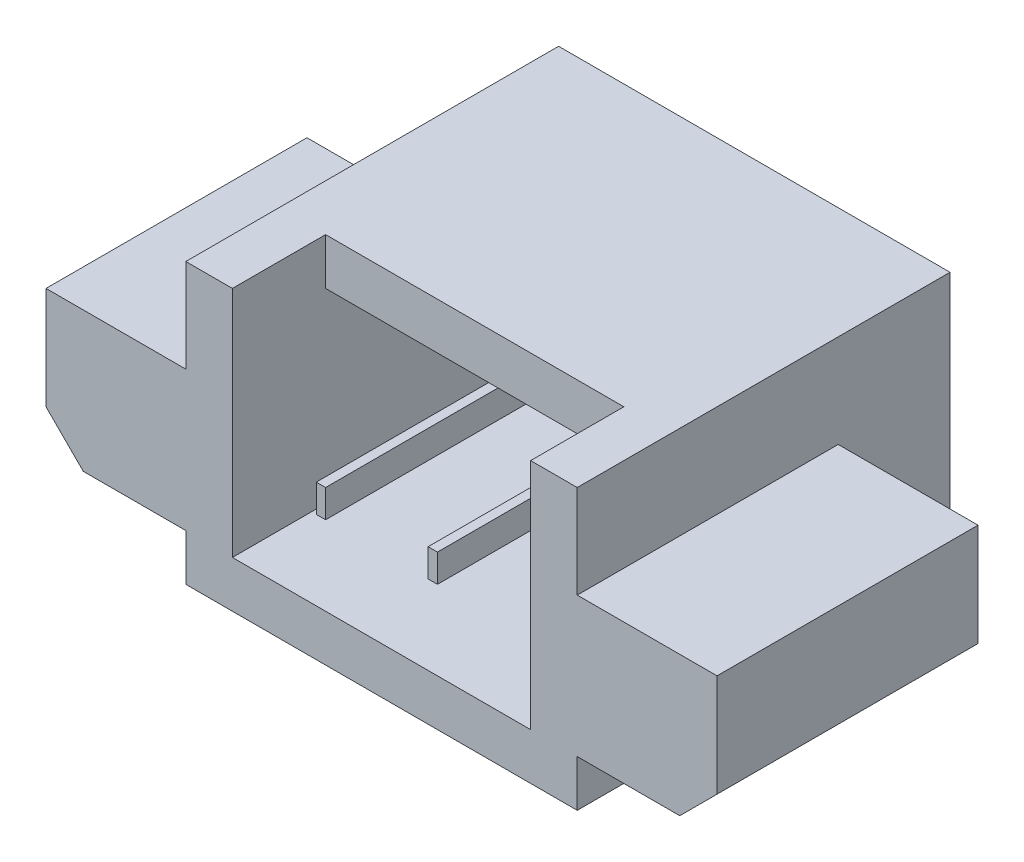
ISO-10303-21;
HEADER;
FILE_DESCRIPTION(('STEP AP214'),'2;1');
FILE_NAME('part.step','',(''),(''),'','','');
FILE_SCHEMA(('AUTOMOTIVE_DESIGN { 1 0 10303 214 1 1 1 1 }'));
ENDSEC;
DATA;
#1=APPLICATION_CONTEXT('core data for automotive mechanical design processes');
#2=APPLICATION_PROTOCOL_DEFINITION('international standard','automotive_design',2000,#1);
#3=PRODUCT_CONTEXT('',#1,'mechanical');
#4=PRODUCT('Part','Part','',(#3));
#5=PRODUCT_RELATED_PRODUCT_CATEGORY('part','',(#4));
#6=PRODUCT_DEFINITION_FORMATION('','',#4);
#7=PRODUCT_DEFINITION_CONTEXT('part definition',#1,'design');
#8=PRODUCT_DEFINITION('design','',#6,#7);
#9=PRODUCT_DEFINITION_SHAPE('','',#8);
#10=(LENGTH_UNIT() NAMED_UNIT(*) SI_UNIT(.MILLI.,.METRE.));
#11=(NAMED_UNIT(*) PLANE_ANGLE_UNIT() SI_UNIT($,.RADIAN.));
#12=(NAMED_UNIT(*) SI_UNIT($,.STERADIAN.) SOLID_ANGLE_UNIT());
#13=UNCERTAINTY_MEASURE_WITH_UNIT(LENGTH_MEASURE(1.E-05),#10,'distance_accuracy_value','');
#14=(GEOMETRIC_REPRESENTATION_CONTEXT(3) GLOBAL_UNCERTAINTY_ASSIGNED_CONTEXT((#13)) GLOBAL_UNIT_ASSIGNED_CONTEXT((#10,
#11,#12)) REPRESENTATION_CONTEXT('',''));
#15=CARTESIAN_POINT('',(0.,0.,0.));
#16=DIRECTION('',(0.,0.,1.));
#17=DIRECTION('',(1.,0.,0.));
#18=AXIS2_PLACEMENT_3D('',#15,#16,#17);
#19=CARTESIAN_POINT('',(0.,0.,0.5));
#20=DIRECTION('',(0.,0.,-1.));
#21=DIRECTION('',(-1.,0.,0.));
#22=AXIS2_PLACEMENT_3D('',#19,#20,#21);
#23=PLANE('',#22);
#24=DIRECTION('',(0.,1.,0.));
#25=VECTOR('',#24,1.);
#26=CARTESIAN_POINT('',(-0.6,0.15,0.5));
#27=LINE('',#26,#25);
#28=CARTESIAN_POINT('',(-0.6,-0.15,0.5));
#29=VERTEX_POINT('',#28);
#30=CARTESIAN_POINT('',(-0.6,0.15,0.5));
#31=VERTEX_POINT('',#30);
#32=EDGE_CURVE('E240',#29,#31,#27,.T.);
#33=ORIENTED_EDGE('',*,*,#32,.F.);
#34=DIRECTION('',(1.,0.,0.));
#35=VECTOR('',#34,1.);
#36=CARTESIAN_POINT('',(-0.7,-0.15,0.5));
#37=LINE('',#36,#35);
#38=CARTESIAN_POINT('',(-0.7,-0.15,0.5));
#39=VERTEX_POINT('',#38);
#40=EDGE_CURVE('E253',#39,#29,#37,.T.);
#41=ORIENTED_EDGE('',*,*,#40,.F.);
#42=DIRECTION('',(0.,-1.,0.));
#43=VECTOR('',#42,1.);
#44=CARTESIAN_POINT('',(-0.7,0.15,0.5));
#45=LINE('',#44,#43);
#46=CARTESIAN_POINT('',(-0.7,0.15,0.5));
#47=VERTEX_POINT('',#46);
#48=EDGE_CURVE('E262',#47,#39,#45,.T.);
#49=ORIENTED_EDGE('',*,*,#48,.F.);
#50=DIRECTION('',(-1.,0.,0.));
#51=VECTOR('',#50,1.);
#52=CARTESIAN_POINT('',(-0.7,0.15,0.5));
#53=LINE('',#52,#51);
#54=EDGE_CURVE('E243',#31,#47,#53,.T.);
#55=ORIENTED_EDGE('',*,*,#54,.F.);
#56=EDGE_LOOP('',(#33,#41,#49,#55));
#57=FACE_BOUND('',#56,.T.);
#58=DIRECTION('',(0.,1.,0.));
#59=VECTOR('',#58,1.);
#60=CARTESIAN_POINT('',(-1.6,1.,0.5));
#61=LINE('',#60,#59);
#62=CARTESIAN_POINT('',(-1.6,-1.,0.5));
#63=VERTEX_POINT('',#62);
#64=CARTESIAN_POINT('',(-1.6,1.,0.5));
#65=VERTEX_POINT('',#64);
#66=EDGE_CURVE('E300',#63,#65,#61,.T.);
#67=ORIENTED_EDGE('',*,*,#66,.F.);
#68=DIRECTION('',(-1.,0.,0.));
#69=VECTOR('',#68,1.);
#70=CARTESIAN_POINT('',(-1.6,-1.,0.5));
#71=LINE('',#70,#69);
#72=CARTESIAN_POINT('',(1.6,-1.,0.5));
#73=VERTEX_POINT('',#72);
#74=EDGE_CURVE('E297',#73,#63,#71,.T.);
#75=ORIENTED_EDGE('',*,*,#74,.F.);
#76=DIRECTION('',(0.,-1.,0.));
#77=VECTOR('',#76,1.);
#78=CARTESIAN_POINT('',(1.6,1.,0.5));
#79=LINE('',#78,#77);
#80=CARTESIAN_POINT('',(1.6,1.,0.5));
#81=VERTEX_POINT('',#80);
#82=EDGE_CURVE('E293',#81,#73,#79,.T.);
#83=ORIENTED_EDGE('',*,*,#82,.F.);
#84=DIRECTION('',(1.,0.,0.));
#85=VECTOR('',#84,1.);
#86=CARTESIAN_POINT('',(-1.6,1.,0.5));
#87=LINE('',#86,#85);
#88=EDGE_CURVE('E11',#65,#81,#87,.T.);
#89=ORIENTED_EDGE('',*,*,#88,.F.);
#90=EDGE_LOOP('',(#67,#75,#83,#89));
#91=FACE_BOUND('',#90,.T.);
#92=DIRECTION('',(1.,0.,0.));
#93=VECTOR('',#92,1.);
#94=CARTESIAN_POINT('',(0.499999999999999,-0.15,0.5));
#95=LINE('',#94,#93);
#96=CARTESIAN_POINT('',(0.499999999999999,-0.15,0.5));
#97=VERTEX_POINT('',#96);
#98=CARTESIAN_POINT('',(0.599999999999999,-0.15,0.5));
#99=VERTEX_POINT('',#98);
#100=EDGE_CURVE('E239',#97,#99,#95,.T.);
#101=ORIENTED_EDGE('',*,*,#100,.F.);
#102=DIRECTION('',(0.,-1.,0.));
#103=VECTOR('',#102,1.);
#104=CARTESIAN_POINT('',(0.499999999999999,0.15,0.5));
#105=LINE('',#104,#103);
#106=CARTESIAN_POINT('',(0.499999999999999,0.15,0.5));
#107=VERTEX_POINT('',#106);
#108=EDGE_CURVE('E236',#107,#97,#105,.T.);
#109=ORIENTED_EDGE('',*,*,#108,.F.);
#110=DIRECTION('',(-1.,0.,0.));
#111=VECTOR('',#110,1.);
#112=CARTESIAN_POINT('',(0.499999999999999,0.15,0.5));
#113=LINE('',#112,#111);
#114=CARTESIAN_POINT('',(0.599999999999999,0.15,0.5));
#115=VERTEX_POINT('',#114);
#116=EDGE_CURVE('E54',#115,#107,#113,.T.);
#117=ORIENTED_EDGE('',*,*,#116,.F.);
#118=DIRECTION('',(0.,1.,0.));
#119=VECTOR('',#118,1.);
#120=CARTESIAN_POINT('',(0.599999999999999,0.15,0.5));
#121=LINE('',#120,#119);
#122=EDGE_CURVE('E49',#99,#115,#121,.T.);
#123=ORIENTED_EDGE('',*,*,#122,.F.);
#124=EDGE_LOOP('',(#101,#109,#117,#123));
#125=FACE_BOUND('',#124,.T.);
#126=ADVANCED_FACE('F34',(#57,#91,#125),#23,.F.);
#127=CARTESIAN_POINT('',(-1.6,1.,4.));
#128=DIRECTION('',(1.,0.,0.));
#129=DIRECTION('',(0.,1.,0.));
#130=AXIS2_PLACEMENT_3D('',#127,#128,#129);
#131=PLANE('',#130);
#132=DIRECTION('',(0.,0.,-1.));
#133=VECTOR('',#132,1.);
#134=CARTESIAN_POINT('',(-1.6,-1.,4.));
#135=LINE('',#134,#133);
#136=CARTESIAN_POINT('',(-1.6,-1.,4.));
#137=VERTEX_POINT('',#136);
#138=EDGE_CURVE('E391',#137,#63,#135,.T.);
#139=ORIENTED_EDGE('',*,*,#138,.T.);
#140=ORIENTED_EDGE('',*,*,#66,.T.);
#141=DIRECTION('',(0.,0.,-1.));
#142=VECTOR('',#141,1.);
#143=CARTESIAN_POINT('',(-1.6,1.,4.));
#144=LINE('',#143,#142);
#145=CARTESIAN_POINT('',(-1.6,1.,3.));
#146=VERTEX_POINT('',#145);
#147=EDGE_CURVE('E384',#146,#65,#144,.T.);
#148=ORIENTED_EDGE('',*,*,#147,.F.);
#149=DIRECTION('',(0.,1.,0.));
#150=VECTOR('',#149,1.);
#151=CARTESIAN_POINT('',(-1.6,1.,3.));
#152=LINE('',#151,#150);
#153=CARTESIAN_POINT('',(-1.6,1.5,3.));
#154=VERTEX_POINT('',#153);
#155=EDGE_CURVE('E291',#146,#154,#152,.T.);
#156=ORIENTED_EDGE('',*,*,#155,.T.);
#157=DIRECTION('',(0.,0.,1.));
#158=VECTOR('',#157,1.);
#159=CARTESIAN_POINT('',(-1.6,1.5,4.));
#160=LINE('',#159,#158);
#161=CARTESIAN_POINT('',(-1.6,1.5,4.));
#162=VERTEX_POINT('',#161);
#163=EDGE_CURVE('E278',#154,#162,#160,.T.);
#164=ORIENTED_EDGE('',*,*,#163,.T.);
#165=DIRECTION('',(0.,-1.,0.));
#166=VECTOR('',#165,1.);
#167=CARTESIAN_POINT('',(-1.6,1.,4.));
#168=LINE('',#167,#166);
#169=EDGE_CURVE('E370',#162,#137,#168,.T.);
#170=ORIENTED_EDGE('',*,*,#169,.T.);
#171=EDGE_LOOP('',(#139,#140,#148,#156,#164,#170));
#172=FACE_BOUND('',#171,.T.);
#173=ADVANCED_FACE('F458',(#172),#131,.T.);
#174=CARTESIAN_POINT('',(-1.6,-1.,4.));
#175=DIRECTION('',(0.,1.,0.));
#176=DIRECTION('',(-1.,0.,0.));
#177=AXIS2_PLACEMENT_3D('',#174,#175,#176);
#178=PLANE('',#177);
#179=DIRECTION('',(0.,0.,-1.));
#180=VECTOR('',#179,1.);
#181=CARTESIAN_POINT('',(1.6,-1.,4.));
#182=LINE('',#181,#180);
#183=CARTESIAN_POINT('',(1.6,-1.,4.));
#184=VERTEX_POINT('',#183);
#185=EDGE_CURVE('E388',#184,#73,#182,.T.);
#186=ORIENTED_EDGE('',*,*,#185,.T.);
#187=ORIENTED_EDGE('',*,*,#74,.T.);
#188=ORIENTED_EDGE('',*,*,#138,.F.);
#189=DIRECTION('',(1.,0.,0.));
#190=VECTOR('',#189,1.);
#191=CARTESIAN_POINT('',(-1.6,-1.,4.));
#192=LINE('',#191,#190);
#193=EDGE_CURVE('E380',#137,#184,#192,.T.);
#194=ORIENTED_EDGE('',*,*,#193,.T.);
#195=EDGE_LOOP('',(#186,#187,#188,#194));
#196=FACE_BOUND('',#195,.T.);
#197=ADVANCED_FACE('F510',(#196),#178,.T.);
#198=CARTESIAN_POINT('',(1.6,1.,4.));
#199=DIRECTION('',(-1.,0.,0.));
#200=DIRECTION('',(0.,-1.,0.));
#201=AXIS2_PLACEMENT_3D('',#198,#199,#200);
#202=PLANE('',#201);
#203=DIRECTION('',(0.,1.,0.));
#204=VECTOR('',#203,1.);
#205=CARTESIAN_POINT('',(1.6,1.,4.));
#206=LINE('',#205,#204);
#207=CARTESIAN_POINT('',(1.6,1.5,4.));
#208=VERTEX_POINT('',#207);
#209=EDGE_CURVE('E382',#184,#208,#206,.T.);
#210=ORIENTED_EDGE('',*,*,#209,.T.);
#211=DIRECTION('',(0.,0.,-1.));
#212=VECTOR('',#211,1.);
#213=CARTESIAN_POINT('',(1.6,1.5,4.));
#214=LINE('',#213,#212);
#215=CARTESIAN_POINT('',(1.6,1.5,3.));
#216=VERTEX_POINT('',#215);
#217=EDGE_CURVE('E286',#208,#216,#214,.T.);
#218=ORIENTED_EDGE('',*,*,#217,.T.);
#219=DIRECTION('',(0.,1.,0.));
#220=VECTOR('',#219,1.);
#221=CARTESIAN_POINT('',(1.6,1.,3.));
#222=LINE('',#221,#220);
#223=CARTESIAN_POINT('',(1.6,1.,3.));
#224=VERTEX_POINT('',#223);
#225=EDGE_CURVE('E282',#224,#216,#222,.T.);
#226=ORIENTED_EDGE('',*,*,#225,.F.);
#227=DIRECTION('',(0.,0.,-1.));
#228=VECTOR('',#227,1.);
#229=CARTESIAN_POINT('',(1.6,1.,4.));
#230=LINE('',#229,#228);
#231=EDGE_CURVE('E386',#224,#81,#230,.T.);
#232=ORIENTED_EDGE('',*,*,#231,.T.);
#233=ORIENTED_EDGE('',*,*,#82,.T.);
#234=ORIENTED_EDGE('',*,*,#185,.F.);
#235=EDGE_LOOP('',(#210,#218,#226,#232,#233,#234));
#236=FACE_BOUND('',#235,.T.);
#237=ADVANCED_FACE('F541',(#236),#202,.T.);
#238=CARTESIAN_POINT('',(-1.6,1.,4.));
#239=DIRECTION('',(0.,-1.,0.));
#240=DIRECTION('',(0.,0.,-1.));
#241=AXIS2_PLACEMENT_3D('',#238,#239,#240);
#242=PLANE('',#241);
#243=DIRECTION('',(-1.,0.,0.));
#244=VECTOR('',#243,1.);
#245=CARTESIAN_POINT('',(-1.6,1.,3.));
#246=LINE('',#245,#244);
#247=EDGE_CURVE('E279',#224,#146,#246,.T.);
#248=ORIENTED_EDGE('',*,*,#247,.T.);
#249=ORIENTED_EDGE('',*,*,#147,.T.);
#250=ORIENTED_EDGE('',*,*,#88,.T.);
#251=ORIENTED_EDGE('',*,*,#231,.F.);
#252=EDGE_LOOP('',(#248,#249,#250,#251));
#253=FACE_BOUND('',#252,.T.);
#254=ADVANCED_FACE('F538',(#253),#242,.T.);
#255=CARTESIAN_POINT('',(2.1,1.5,4.));
#256=DIRECTION('',(-1.,0.,0.));
#257=DIRECTION('',(0.,-1.,0.));
#258=AXIS2_PLACEMENT_3D('',#255,#256,#257);
#259=PLANE('',#258);
#260=DIRECTION('',(0.,1.,0.));
#261=VECTOR('',#260,1.);
#262=CARTESIAN_POINT('',(2.1,1.5,0.));
#263=LINE('',#262,#261);
#264=CARTESIAN_POINT('',(2.1,-1.5,0.));
#265=VERTEX_POINT('',#264);
#266=CARTESIAN_POINT('',(2.1,1.5,0.));
#267=VERTEX_POINT('',#266);
#268=EDGE_CURVE('E394',#265,#267,#263,.T.);
#269=ORIENTED_EDGE('',*,*,#268,.T.);
#270=DIRECTION('',(0.,0.,-1.));
#271=VECTOR('',#270,1.);
#272=CARTESIAN_POINT('',(2.1,1.5,4.));
#273=LINE('',#272,#271);
#274=CARTESIAN_POINT('',(2.1,1.5,4.));
#275=VERTEX_POINT('',#274);
#276=EDGE_CURVE('E42',#275,#267,#273,.T.);
#277=ORIENTED_EDGE('',*,*,#276,.F.);
#278=DIRECTION('',(0.,1.,0.));
#279=VECTOR('',#278,1.);
#280=CARTESIAN_POINT('',(2.1,1.5,4.));
#281=LINE('',#280,#279);
#282=CARTESIAN_POINT('',(2.1,0.5,4.));
#283=VERTEX_POINT('',#282);
#284=EDGE_CURVE('E399',#283,#275,#281,.T.);
#285=ORIENTED_EDGE('',*,*,#284,.F.);
#286=DIRECTION('',(0.,0.,1.));
#287=VECTOR('',#286,1.);
#288=CARTESIAN_POINT('',(2.1,0.5,1.2));
#289=LINE('',#288,#287);
#290=CARTESIAN_POINT('',(2.1,0.5,1.2));
#291=VERTEX_POINT('',#290);
#292=EDGE_CURVE('E334',#291,#283,#289,.T.);
#293=ORIENTED_EDGE('',*,*,#292,.F.);
#294=DIRECTION('',(0.,-1.,0.));
#295=VECTOR('',#294,1.);
#296=CARTESIAN_POINT('',(2.1,-1.,1.2));
#297=LINE('',#296,#295);
#298=CARTESIAN_POINT('',(2.1,-1.,1.2));
#299=VERTEX_POINT('',#298);
#300=EDGE_CURVE('E316',#291,#299,#297,.T.);
#301=ORIENTED_EDGE('',*,*,#300,.T.);
#302=DIRECTION('',(0.,0.,1.));
#303=VECTOR('',#302,1.);
#304=CARTESIAN_POINT('',(2.1,-1.,1.2));
#305=LINE('',#304,#303);
#306=CARTESIAN_POINT('',(2.1,-1.,4.));
#307=VERTEX_POINT('',#306);
#308=EDGE_CURVE('E330',#299,#307,#305,.T.);
#309=ORIENTED_EDGE('',*,*,#308,.T.);
#310=CARTESIAN_POINT('',(2.1,-1.5,4.));
#311=VERTEX_POINT('',#310);
#312=EDGE_CURVE('E395',#311,#307,#281,.T.);
#313=ORIENTED_EDGE('',*,*,#312,.F.);
#314=DIRECTION('',(0.,0.,-1.));
#315=VECTOR('',#314,1.);
#316=CARTESIAN_POINT('',(2.1,-1.5,4.));
#317=LINE('',#316,#315);
#318=EDGE_CURVE('E409',#311,#265,#317,.T.);
#319=ORIENTED_EDGE('',*,*,#318,.T.);
#320=EDGE_LOOP('',(#269,#277,#285,#293,#301,#309,#313,#319));
#321=FACE_BOUND('',#320,.T.);
#322=ADVANCED_FACE('F36',(#321),#259,.F.);
#323=CARTESIAN_POINT('',(-2.1,1.5,4.));
#324=DIRECTION('',(1.,0.,0.));
#325=DIRECTION('',(0.,0.,-1.));
#326=AXIS2_PLACEMENT_3D('',#323,#324,#325);
#327=PLANE('',#326);
#328=DIRECTION('',(0.,-1.,0.));
#329=VECTOR('',#328,1.);
#330=CARTESIAN_POINT('',(-2.1,1.5,0.));
#331=LINE('',#330,#329);
#332=CARTESIAN_POINT('',(-2.1,1.5,0.));
#333=VERTEX_POINT('',#332);
#334=CARTESIAN_POINT('',(-2.1,-1.5,0.));
#335=VERTEX_POINT('',#334);
#336=EDGE_CURVE('E415',#333,#335,#331,.T.);
#337=ORIENTED_EDGE('',*,*,#336,.T.);
#338=DIRECTION('',(0.,0.,-1.));
#339=VECTOR('',#338,1.);
#340=CARTESIAN_POINT('',(-2.1,-1.5,4.));
#341=LINE('',#340,#339);
#342=CARTESIAN_POINT('',(-2.1,-1.5,4.));
#343=VERTEX_POINT('',#342);
#344=EDGE_CURVE('E422',#343,#335,#341,.T.);
#345=ORIENTED_EDGE('',*,*,#344,.F.);
#346=DIRECTION('',(0.,-1.,0.));
#347=VECTOR('',#346,1.);
#348=CARTESIAN_POINT('',(-2.1,1.5,4.));
#349=LINE('',#348,#347);
#350=CARTESIAN_POINT('',(-2.1,-1.,4.));
#351=VERTEX_POINT('',#350);
#352=EDGE_CURVE('E403',#351,#343,#349,.T.);
#353=ORIENTED_EDGE('',*,*,#352,.F.);
#354=DIRECTION('',(0.,0.,1.));
#355=VECTOR('',#354,1.);
#356=CARTESIAN_POINT('',(-2.1,-1.,1.2));
#357=LINE('',#356,#355);
#358=CARTESIAN_POINT('',(-2.1,-1.,1.2));
#359=VERTEX_POINT('',#358);
#360=EDGE_CURVE('E368',#359,#351,#357,.T.);
#361=ORIENTED_EDGE('',*,*,#360,.F.);
#362=DIRECTION('',(0.,1.,0.));
#363=VECTOR('',#362,1.);
#364=CARTESIAN_POINT('',(-2.1,-1.,1.2));
#365=LINE('',#364,#363);
#366=CARTESIAN_POINT('',(-2.1,0.5,1.2));
#367=VERTEX_POINT('',#366);
#368=EDGE_CURVE('E341',#359,#367,#365,.T.);
#369=ORIENTED_EDGE('',*,*,#368,.T.);
#370=DIRECTION('',(0.,0.,1.));
#371=VECTOR('',#370,1.);
#372=CARTESIAN_POINT('',(-2.1,0.5,1.2));
#373=LINE('',#372,#371);
#374=CARTESIAN_POINT('',(-2.1,0.5,4.));
#375=VERTEX_POINT('',#374);
#376=EDGE_CURVE('E357',#367,#375,#373,.T.);
#377=ORIENTED_EDGE('',*,*,#376,.T.);
#378=CARTESIAN_POINT('',(-2.1,1.5,4.));
#379=VERTEX_POINT('',#378);
#380=EDGE_CURVE('E404',#379,#375,#349,.T.);
#381=ORIENTED_EDGE('',*,*,#380,.F.);
#382=DIRECTION('',(0.,0.,-1.));
#383=VECTOR('',#382,1.);
#384=CARTESIAN_POINT('',(-2.1,1.5,4.));
#385=LINE('',#384,#383);
#386=EDGE_CURVE('E424',#379,#333,#385,.T.);
#387=ORIENTED_EDGE('',*,*,#386,.T.);
#388=EDGE_LOOP('',(#337,#345,#353,#361,#369,#377,#381,#387));
#389=FACE_BOUND('',#388,.T.);
#390=ADVANCED_FACE('F448',(#389),#327,.F.);
#391=CARTESIAN_POINT('',(0.,0.,4.));
#392=DIRECTION('',(0.,0.,1.));
#393=DIRECTION('',(1.,0.,0.));
#394=AXIS2_PLACEMENT_3D('',#391,#392,#393);
#395=PLANE('',#394);
#396=ORIENTED_EDGE('',*,*,#169,.F.);
#397=DIRECTION('',(-1.,0.,0.));
#398=VECTOR('',#397,1.);
#399=CARTESIAN_POINT('',(-2.1,1.5,4.));
#400=LINE('',#399,#398);
#401=EDGE_CURVE('E398',#162,#379,#400,.T.);
#402=ORIENTED_EDGE('',*,*,#401,.T.);
#403=ORIENTED_EDGE('',*,*,#380,.T.);
#404=DIRECTION('',(-1.,0.,0.));
#405=VECTOR('',#404,1.);
#406=CARTESIAN_POINT('',(-2.1,0.5,4.));
#407=LINE('',#406,#405);
#408=CARTESIAN_POINT('',(-3.6,0.5,4.));
#409=VERTEX_POINT('',#408);
#410=EDGE_CURVE('E333',#375,#409,#407,.T.);
#411=ORIENTED_EDGE('',*,*,#410,.T.);
#412=DIRECTION('',(0.,-1.,0.));
#413=VECTOR('',#412,1.);
#414=CARTESIAN_POINT('',(-3.6,-0.600000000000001,4.));
#415=LINE('',#414,#413);
#416=CARTESIAN_POINT('',(-3.6,-0.600000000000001,4.));
#417=VERTEX_POINT('',#416);
#418=EDGE_CURVE('E360',#409,#417,#415,.T.);
#419=ORIENTED_EDGE('',*,*,#418,.T.);
#420=DIRECTION('',(0.707106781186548,-0.707106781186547,0.));
#421=VECTOR('',#420,1.);
#422=CARTESIAN_POINT('',(-3.2,-1.,4.));
#423=LINE('',#422,#421);
#424=CARTESIAN_POINT('',(-3.2,-1.,4.));
#425=VERTEX_POINT('',#424);
#426=EDGE_CURVE('E363',#417,#425,#423,.T.);
#427=ORIENTED_EDGE('',*,*,#426,.T.);
#428=DIRECTION('',(1.,0.,0.));
#429=VECTOR('',#428,1.);
#430=CARTESIAN_POINT('',(-2.1,-1.,4.));
#431=LINE('',#430,#429);
#432=EDGE_CURVE('E345',#425,#351,#431,.T.);
#433=ORIENTED_EDGE('',*,*,#432,.T.);
#434=ORIENTED_EDGE('',*,*,#352,.T.);
#435=DIRECTION('',(1.,0.,0.));
#436=VECTOR('',#435,1.);
#437=CARTESIAN_POINT('',(-2.1,-1.5,4.));
#438=LINE('',#437,#436);
#439=EDGE_CURVE('E407',#343,#311,#438,.T.);
#440=ORIENTED_EDGE('',*,*,#439,.T.);
#441=ORIENTED_EDGE('',*,*,#312,.T.);
#442=DIRECTION('',(1.,0.,0.));
#443=VECTOR('',#442,1.);
#444=CARTESIAN_POINT('',(2.1,-1.,4.));
#445=LINE('',#444,#443);
#446=CARTESIAN_POINT('',(3.2,-1.,4.));
#447=VERTEX_POINT('',#446);
#448=EDGE_CURVE('E303',#307,#447,#445,.T.);
#449=ORIENTED_EDGE('',*,*,#448,.T.);
#450=DIRECTION('',(0.707106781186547,0.707106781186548,0.));
#451=VECTOR('',#450,1.);
#452=CARTESIAN_POINT('',(3.2,-1.,4.));
#453=LINE('',#452,#451);
#454=CARTESIAN_POINT('',(3.6,-0.6,4.));
#455=VERTEX_POINT('',#454);
#456=EDGE_CURVE('E322',#447,#455,#453,.T.);
#457=ORIENTED_EDGE('',*,*,#456,.T.);
#458=DIRECTION('',(0.,1.,0.));
#459=VECTOR('',#458,1.);
#460=CARTESIAN_POINT('',(3.6,-0.6,4.));
#461=LINE('',#460,#459);
#462=CARTESIAN_POINT('',(3.6,0.5,4.));
#463=VERTEX_POINT('',#462);
#464=EDGE_CURVE('E325',#455,#463,#461,.T.);
#465=ORIENTED_EDGE('',*,*,#464,.T.);
#466=DIRECTION('',(-1.,0.,0.));
#467=VECTOR('',#466,1.);
#468=CARTESIAN_POINT('',(2.1,0.5,4.));
#469=LINE('',#468,#467);
#470=EDGE_CURVE('E308',#463,#283,#469,.T.);
#471=ORIENTED_EDGE('',*,*,#470,.T.);
#472=ORIENTED_EDGE('',*,*,#284,.T.);
#473=EDGE_CURVE('E400',#275,#208,#400,.T.);
#474=ORIENTED_EDGE('',*,*,#473,.T.);
#475=ORIENTED_EDGE('',*,*,#209,.F.);
#476=ORIENTED_EDGE('',*,*,#193,.F.);
#477=EDGE_LOOP('',(#396,#402,#403,#411,#419,#427,#433,#434,#440,#441,#449,#457,#465,#471,#472,
#474,#475,#476));
#478=FACE_BOUND('',#477,.T.);
#479=ADVANCED_FACE('F453',(#478),#395,.T.);
#480=CARTESIAN_POINT('',(0.,0.,0.));
#481=DIRECTION('',(0.,0.,1.));
#482=DIRECTION('',(1.,0.,0.));
#483=AXIS2_PLACEMENT_3D('',#480,#481,#482);
#484=PLANE('',#483);
#485=ORIENTED_EDGE('',*,*,#268,.F.);
#486=DIRECTION('',(1.,0.,0.));
#487=VECTOR('',#486,1.);
#488=CARTESIAN_POINT('',(-2.1,-1.5,0.));
#489=LINE('',#488,#487);
#490=EDGE_CURVE('E418',#335,#265,#489,.T.);
#491=ORIENTED_EDGE('',*,*,#490,.F.);
#492=ORIENTED_EDGE('',*,*,#336,.F.);
#493=DIRECTION('',(-1.,0.,0.));
#494=VECTOR('',#493,1.);
#495=CARTESIAN_POINT('',(-2.1,1.5,0.));
#496=LINE('',#495,#494);
#497=EDGE_CURVE('E412',#267,#333,#496,.T.);
#498=ORIENTED_EDGE('',*,*,#497,.F.);
#499=EDGE_LOOP('',(#485,#491,#492,#498));
#500=FACE_BOUND('',#499,.T.);
#501=ADVANCED_FACE('F438',(#500),#484,.F.);
#502=CARTESIAN_POINT('',(-2.1,1.5,4.));
#503=DIRECTION('',(0.,-1.,0.));
#504=DIRECTION('',(0.,0.,-1.));
#505=AXIS2_PLACEMENT_3D('',#502,#503,#504);
#506=PLANE('',#505);
#507=ORIENTED_EDGE('',*,*,#401,.F.);
#508=ORIENTED_EDGE('',*,*,#163,.F.);
#509=DIRECTION('',(-1.,0.,0.));
#510=VECTOR('',#509,1.);
#511=CARTESIAN_POINT('',(-1.6,1.5,3.));
#512=LINE('',#511,#510);
#513=EDGE_CURVE('E283',#216,#154,#512,.T.);
#514=ORIENTED_EDGE('',*,*,#513,.F.);
#515=ORIENTED_EDGE('',*,*,#217,.F.);
#516=ORIENTED_EDGE('',*,*,#473,.F.);
#517=ORIENTED_EDGE('',*,*,#276,.T.);
#518=ORIENTED_EDGE('',*,*,#497,.T.);
#519=ORIENTED_EDGE('',*,*,#386,.F.);
#520=EDGE_LOOP('',(#507,#508,#514,#515,#516,#517,#518,#519));
#521=FACE_BOUND('',#520,.T.);
#522=ADVANCED_FACE('F430',(#521),#506,.F.);
#523=CARTESIAN_POINT('',(-2.1,-1.5,4.));
#524=DIRECTION('',(0.,1.,0.));
#525=DIRECTION('',(0.,0.,1.));
#526=AXIS2_PLACEMENT_3D('',#523,#524,#525);
#527=PLANE('',#526);
#528=ORIENTED_EDGE('',*,*,#490,.T.);
#529=ORIENTED_EDGE('',*,*,#318,.F.);
#530=ORIENTED_EDGE('',*,*,#439,.F.);
#531=ORIENTED_EDGE('',*,*,#344,.T.);
#532=EDGE_LOOP('',(#528,#529,#530,#531));
#533=FACE_BOUND('',#532,.T.);
#534=ADVANCED_FACE('F444',(#533),#527,.F.);
#535=CARTESIAN_POINT('',(-2.1,-1.,1.2));
#536=DIRECTION('',(0.,-1.,0.));
#537=DIRECTION('',(1.,0.,0.));
#538=AXIS2_PLACEMENT_3D('',#535,#536,#537);
#539=PLANE('',#538);
#540=ORIENTED_EDGE('',*,*,#432,.F.);
#541=DIRECTION('',(0.,0.,1.));
#542=VECTOR('',#541,1.);
#543=CARTESIAN_POINT('',(-3.2,-1.,1.2));
#544=LINE('',#543,#542);
#545=CARTESIAN_POINT('',(-3.2,-1.,1.2));
#546=VERTEX_POINT('',#545);
#547=EDGE_CURVE('E371',#546,#425,#544,.T.);
#548=ORIENTED_EDGE('',*,*,#547,.F.);
#549=DIRECTION('',(1.,0.,0.));
#550=VECTOR('',#549,1.);
#551=CARTESIAN_POINT('',(-2.1,-1.,1.2));
#552=LINE('',#551,#550);
#553=EDGE_CURVE('E354',#546,#359,#552,.T.);
#554=ORIENTED_EDGE('',*,*,#553,.T.);
#555=ORIENTED_EDGE('',*,*,#360,.T.);
#556=EDGE_LOOP('',(#540,#548,#554,#555));
#557=FACE_BOUND('',#556,.T.);
#558=ADVANCED_FACE('F481',(#557),#539,.T.);
#559=CARTESIAN_POINT('',(-3.2,-1.,1.2));
#560=DIRECTION('',(-0.707106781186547,-0.707106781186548,0.));
#561=DIRECTION('',(0.707106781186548,-0.707106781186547,0.));
#562=AXIS2_PLACEMENT_3D('',#559,#560,#561);
#563=PLANE('',#562);
#564=ORIENTED_EDGE('',*,*,#426,.F.);
#565=DIRECTION('',(0.,0.,1.));
#566=VECTOR('',#565,1.);
#567=CARTESIAN_POINT('',(-3.6,-0.600000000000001,1.2));
#568=LINE('',#567,#566);
#569=CARTESIAN_POINT('',(-3.6,-0.600000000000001,1.2));
#570=VERTEX_POINT('',#569);
#571=EDGE_CURVE('E373',#570,#417,#568,.T.);
#572=ORIENTED_EDGE('',*,*,#571,.F.);
#573=DIRECTION('',(0.707106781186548,-0.707106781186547,0.));
#574=VECTOR('',#573,1.);
#575=CARTESIAN_POINT('',(-3.2,-1.,1.2));
#576=LINE('',#575,#574);
#577=EDGE_CURVE('E351',#570,#546,#576,.T.);
#578=ORIENTED_EDGE('',*,*,#577,.T.);
#579=ORIENTED_EDGE('',*,*,#547,.T.);
#580=EDGE_LOOP('',(#564,#572,#578,#579));
#581=FACE_BOUND('',#580,.T.);
#582=ADVANCED_FACE('F495',(#581),#563,.T.);
#583=CARTESIAN_POINT('',(-3.6,-0.600000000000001,1.2));
#584=DIRECTION('',(-1.,0.,0.));
#585=DIRECTION('',(0.,0.,1.));
#586=AXIS2_PLACEMENT_3D('',#583,#584,#585);
#587=PLANE('',#586);
#588=ORIENTED_EDGE('',*,*,#418,.F.);
#589=DIRECTION('',(0.,0.,1.));
#590=VECTOR('',#589,1.);
#591=CARTESIAN_POINT('',(-3.6,0.5,1.2));
#592=LINE('',#591,#590);
#593=CARTESIAN_POINT('',(-3.6,0.5,1.2));
#594=VERTEX_POINT('',#593);
#595=EDGE_CURVE('E375',#594,#409,#592,.T.);
#596=ORIENTED_EDGE('',*,*,#595,.F.);
#597=DIRECTION('',(0.,-1.,0.));
#598=VECTOR('',#597,1.);
#599=CARTESIAN_POINT('',(-3.6,-0.600000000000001,1.2));
#600=LINE('',#599,#598);
#601=EDGE_CURVE('E348',#594,#570,#600,.T.);
#602=ORIENTED_EDGE('',*,*,#601,.T.);
#603=ORIENTED_EDGE('',*,*,#571,.T.);
#604=EDGE_LOOP('',(#588,#596,#602,#603));
#605=FACE_BOUND('',#604,.T.);
#606=ADVANCED_FACE('F493',(#605),#587,.T.);
#607=CARTESIAN_POINT('',(-2.1,0.5,1.2));
#608=DIRECTION('',(0.,1.,0.));
#609=DIRECTION('',(-1.,0.,0.));
#610=AXIS2_PLACEMENT_3D('',#607,#608,#609);
#611=PLANE('',#610);
#612=ORIENTED_EDGE('',*,*,#410,.F.);
#613=ORIENTED_EDGE('',*,*,#376,.F.);
#614=DIRECTION('',(-1.,0.,0.));
#615=VECTOR('',#614,1.);
#616=CARTESIAN_POINT('',(-2.1,0.5,1.2));
#617=LINE('',#616,#615);
#618=EDGE_CURVE('E344',#367,#594,#617,.T.);
#619=ORIENTED_EDGE('',*,*,#618,.T.);
#620=ORIENTED_EDGE('',*,*,#595,.T.);
#621=EDGE_LOOP('',(#612,#613,#619,#620));
#622=FACE_BOUND('',#621,.T.);
#623=ADVANCED_FACE('F489',(#622),#611,.T.);
#624=CARTESIAN_POINT('',(0.,0.,1.2));
#625=DIRECTION('',(0.,0.,1.));
#626=DIRECTION('',(1.,0.,0.));
#627=AXIS2_PLACEMENT_3D('',#624,#625,#626);
#628=PLANE('',#627);
#629=ORIENTED_EDGE('',*,*,#368,.F.);
#630=ORIENTED_EDGE('',*,*,#553,.F.);
#631=ORIENTED_EDGE('',*,*,#577,.F.);
#632=ORIENTED_EDGE('',*,*,#601,.F.);
#633=ORIENTED_EDGE('',*,*,#618,.F.);
#634=EDGE_LOOP('',(#629,#630,#631,#632,#633));
#635=FACE_BOUND('',#634,.T.);
#636=ADVANCED_FACE('F485',(#635),#628,.F.);
#637=CARTESIAN_POINT('',(2.1,-1.,1.2));
#638=DIRECTION('',(0.,-1.,0.));
#639=DIRECTION('',(0.,0.,-1.));
#640=AXIS2_PLACEMENT_3D('',#637,#638,#639);
#641=PLANE('',#640);
#642=ORIENTED_EDGE('',*,*,#448,.F.);
#643=ORIENTED_EDGE('',*,*,#308,.F.);
#644=DIRECTION('',(1.,0.,0.));
#645=VECTOR('',#644,1.);
#646=CARTESIAN_POINT('',(2.1,-1.,1.2));
#647=LINE('',#646,#645);
#648=CARTESIAN_POINT('',(3.2,-1.,1.2));
#649=VERTEX_POINT('',#648);
#650=EDGE_CURVE('E304',#299,#649,#647,.T.);
#651=ORIENTED_EDGE('',*,*,#650,.T.);
#652=DIRECTION('',(0.,0.,1.));
#653=VECTOR('',#652,1.);
#654=CARTESIAN_POINT('',(3.2,-1.,1.2));
#655=LINE('',#654,#653);
#656=EDGE_CURVE('E319',#649,#447,#655,.T.);
#657=ORIENTED_EDGE('',*,*,#656,.T.);
#658=EDGE_LOOP('',(#642,#643,#651,#657));
#659=FACE_BOUND('',#658,.T.);
#660=ADVANCED_FACE('F476',(#659),#641,.T.);
#661=CARTESIAN_POINT('',(2.1,0.5,1.2));
#662=DIRECTION('',(0.,1.,0.));
#663=DIRECTION('',(-1.,0.,0.));
#664=AXIS2_PLACEMENT_3D('',#661,#662,#663);
#665=PLANE('',#664);
#666=ORIENTED_EDGE('',*,*,#470,.F.);
#667=DIRECTION('',(0.,0.,1.));
#668=VECTOR('',#667,1.);
#669=CARTESIAN_POINT('',(3.6,0.5,1.2));
#670=LINE('',#669,#668);
#671=CARTESIAN_POINT('',(3.6,0.5,1.2));
#672=VERTEX_POINT('',#671);
#673=EDGE_CURVE('E336',#672,#463,#670,.T.);
#674=ORIENTED_EDGE('',*,*,#673,.F.);
#675=DIRECTION('',(-1.,0.,0.));
#676=VECTOR('',#675,1.);
#677=CARTESIAN_POINT('',(2.1,0.5,1.2));
#678=LINE('',#677,#676);
#679=EDGE_CURVE('E314',#672,#291,#678,.T.);
#680=ORIENTED_EDGE('',*,*,#679,.T.);
#681=ORIENTED_EDGE('',*,*,#292,.T.);
#682=EDGE_LOOP('',(#666,#674,#680,#681));
#683=FACE_BOUND('',#682,.T.);
#684=ADVANCED_FACE('F468',(#683),#665,.T.);
#685=CARTESIAN_POINT('',(3.6,-0.6,1.2));
#686=DIRECTION('',(1.,0.,0.));
#687=DIRECTION('',(0.,1.,0.));
#688=AXIS2_PLACEMENT_3D('',#685,#686,#687);
#689=PLANE('',#688);
#690=ORIENTED_EDGE('',*,*,#464,.F.);
#691=DIRECTION('',(0.,0.,1.));
#692=VECTOR('',#691,1.);
#693=CARTESIAN_POINT('',(3.6,-0.6,1.2));
#694=LINE('',#693,#692);
#695=CARTESIAN_POINT('',(3.6,-0.6,1.2));
#696=VERTEX_POINT('',#695);
#697=EDGE_CURVE('E338',#696,#455,#694,.T.);
#698=ORIENTED_EDGE('',*,*,#697,.F.);
#699=DIRECTION('',(0.,1.,0.));
#700=VECTOR('',#699,1.);
#701=CARTESIAN_POINT('',(3.6,-0.6,1.2));
#702=LINE('',#701,#700);
#703=EDGE_CURVE('E311',#696,#672,#702,.T.);
#704=ORIENTED_EDGE('',*,*,#703,.T.);
#705=ORIENTED_EDGE('',*,*,#673,.T.);
#706=EDGE_LOOP('',(#690,#698,#704,#705));
#707=FACE_BOUND('',#706,.T.);
#708=ADVANCED_FACE('F521',(#707),#689,.T.);
#709=CARTESIAN_POINT('',(3.2,-1.,1.2));
#710=DIRECTION('',(0.707106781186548,-0.707106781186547,0.));
#711=DIRECTION('',(0.707106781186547,0.707106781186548,0.));
#712=AXIS2_PLACEMENT_3D('',#709,#710,#711);
#713=PLANE('',#712);
#714=ORIENTED_EDGE('',*,*,#456,.F.);
#715=ORIENTED_EDGE('',*,*,#656,.F.);
#716=DIRECTION('',(0.707106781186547,0.707106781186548,0.));
#717=VECTOR('',#716,1.);
#718=CARTESIAN_POINT('',(3.2,-1.,1.2));
#719=LINE('',#718,#717);
#720=EDGE_CURVE('E307',#649,#696,#719,.T.);
#721=ORIENTED_EDGE('',*,*,#720,.T.);
#722=ORIENTED_EDGE('',*,*,#697,.T.);
#723=EDGE_LOOP('',(#714,#715,#721,#722));
#724=FACE_BOUND('',#723,.T.);
#725=ADVANCED_FACE('F518',(#724),#713,.T.);
#726=CARTESIAN_POINT('',(0.,0.,1.2));
#727=DIRECTION('',(0.,0.,1.));
#728=DIRECTION('',(1.,0.,0.));
#729=AXIS2_PLACEMENT_3D('',#726,#727,#728);
#730=PLANE('',#729);
#731=ORIENTED_EDGE('',*,*,#650,.F.);
#732=ORIENTED_EDGE('',*,*,#300,.F.);
#733=ORIENTED_EDGE('',*,*,#679,.F.);
#734=ORIENTED_EDGE('',*,*,#703,.F.);
#735=ORIENTED_EDGE('',*,*,#720,.F.);
#736=EDGE_LOOP('',(#731,#732,#733,#734,#735));
#737=FACE_BOUND('',#736,.T.);
#738=ADVANCED_FACE('F473',(#737),#730,.F.);
#739=CARTESIAN_POINT('',(-1.6,1.,3.));
#740=DIRECTION('',(0.,0.,-1.));
#741=DIRECTION('',(-1.,0.,0.));
#742=AXIS2_PLACEMENT_3D('',#739,#740,#741);
#743=PLANE('',#742);
#744=ORIENTED_EDGE('',*,*,#513,.T.);
#745=ORIENTED_EDGE('',*,*,#155,.F.);
#746=ORIENTED_EDGE('',*,*,#247,.F.);
#747=ORIENTED_EDGE('',*,*,#225,.T.);
#748=EDGE_LOOP('',(#744,#745,#746,#747));
#749=FACE_BOUND('',#748,.T.);
#750=ADVANCED_FACE('F462',(#749),#743,.F.);
#751=CARTESIAN_POINT('',(-0.6,0.15,4.));
#752=DIRECTION('',(-1.,0.,0.));
#753=DIRECTION('',(0.,0.,1.));
#754=AXIS2_PLACEMENT_3D('',#751,#752,#753);
#755=PLANE('',#754);
#756=ORIENTED_EDGE('',*,*,#32,.T.);
#757=DIRECTION('',(0.,0.,-1.));
#758=VECTOR('',#757,1.);
#759=CARTESIAN_POINT('',(-0.6,0.15,4.));
#760=LINE('',#759,#758);
#761=CARTESIAN_POINT('',(-0.6,0.15,4.));
#762=VERTEX_POINT('',#761);
#763=EDGE_CURVE('E275',#762,#31,#760,.T.);
#764=ORIENTED_EDGE('',*,*,#763,.F.);
#765=DIRECTION('',(0.,1.,0.));
#766=VECTOR('',#765,1.);
#767=CARTESIAN_POINT('',(-0.6,0.15,4.));
#768=LINE('',#767,#766);
#769=CARTESIAN_POINT('',(-0.6,-0.15,4.));
#770=VERTEX_POINT('',#769);
#771=EDGE_CURVE('E249',#770,#762,#768,.T.);
#772=ORIENTED_EDGE('',*,*,#771,.F.);
#773=DIRECTION('',(0.,0.,-1.));
#774=VECTOR('',#773,1.);
#775=CARTESIAN_POINT('',(-0.6,-0.15,4.));
#776=LINE('',#775,#774);
#777=EDGE_CURVE('E258',#770,#29,#776,.T.);
#778=ORIENTED_EDGE('',*,*,#777,.T.);
#779=EDGE_LOOP('',(#756,#764,#772,#778));
#780=FACE_BOUND('',#779,.T.);
#781=ADVANCED_FACE('F674',(#780),#755,.F.);
#782=CARTESIAN_POINT('',(-0.7,0.15,4.));
#783=DIRECTION('',(0.,-1.,0.));
#784=DIRECTION('',(0.,0.,-1.));
#785=AXIS2_PLACEMENT_3D('',#782,#783,#784);
#786=PLANE('',#785);
#787=ORIENTED_EDGE('',*,*,#54,.T.);
#788=DIRECTION('',(0.,0.,-1.));
#789=VECTOR('',#788,1.);
#790=CARTESIAN_POINT('',(-0.7,0.15,4.));
#791=LINE('',#790,#789);
#792=CARTESIAN_POINT('',(-0.7,0.15,4.));
#793=VERTEX_POINT('',#792);
#794=EDGE_CURVE('E272',#793,#47,#791,.T.);
#795=ORIENTED_EDGE('',*,*,#794,.F.);
#796=DIRECTION('',(-1.,0.,0.));
#797=VECTOR('',#796,1.);
#798=CARTESIAN_POINT('',(-0.7,0.15,4.));
#799=LINE('',#798,#797);
#800=EDGE_CURVE('E252',#762,#793,#799,.T.);
#801=ORIENTED_EDGE('',*,*,#800,.F.);
#802=ORIENTED_EDGE('',*,*,#763,.T.);
#803=EDGE_LOOP('',(#787,#795,#801,#802));
#804=FACE_BOUND('',#803,.T.);
#805=ADVANCED_FACE('F685',(#804),#786,.F.);
#806=CARTESIAN_POINT('',(-0.7,0.15,4.));
#807=DIRECTION('',(1.,0.,0.));
#808=DIRECTION('',(0.,0.,-1.));
#809=AXIS2_PLACEMENT_3D('',#806,#807,#808);
#810=PLANE('',#809);
#811=ORIENTED_EDGE('',*,*,#48,.T.);
#812=DIRECTION('',(0.,0.,-1.));
#813=VECTOR('',#812,1.);
#814=CARTESIAN_POINT('',(-0.7,-0.15,4.));
#815=LINE('',#814,#813);
#816=CARTESIAN_POINT('',(-0.7,-0.15,4.));
#817=VERTEX_POINT('',#816);
#818=EDGE_CURVE('E269',#817,#39,#815,.T.);
#819=ORIENTED_EDGE('',*,*,#818,.F.);
#820=DIRECTION('',(0.,-1.,0.));
#821=VECTOR('',#820,1.);
#822=CARTESIAN_POINT('',(-0.7,0.15,4.));
#823=LINE('',#822,#821);
#824=EDGE_CURVE('E255',#793,#817,#823,.T.);
#825=ORIENTED_EDGE('',*,*,#824,.F.);
#826=ORIENTED_EDGE('',*,*,#794,.T.);
#827=EDGE_LOOP('',(#811,#819,#825,#826));
#828=FACE_BOUND('',#827,.T.);
#829=ADVANCED_FACE('F693',(#828),#810,.F.);
#830=CARTESIAN_POINT('',(-0.7,-0.15,4.));
#831=DIRECTION('',(0.,1.,0.));
#832=DIRECTION('',(0.,0.,1.));
#833=AXIS2_PLACEMENT_3D('',#830,#831,#832);
#834=PLANE('',#833);
#835=ORIENTED_EDGE('',*,*,#40,.T.);
#836=ORIENTED_EDGE('',*,*,#777,.F.);
#837=DIRECTION('',(1.,0.,0.));
#838=VECTOR('',#837,1.);
#839=CARTESIAN_POINT('',(-0.7,-0.15,4.));
#840=LINE('',#839,#838);
#841=EDGE_CURVE('E257',#817,#770,#840,.T.);
#842=ORIENTED_EDGE('',*,*,#841,.F.);
#843=ORIENTED_EDGE('',*,*,#818,.T.);
#844=EDGE_LOOP('',(#835,#836,#842,#843));
#845=FACE_BOUND('',#844,.T.);
#846=ADVANCED_FACE('F702',(#845),#834,.F.);
#847=CARTESIAN_POINT('',(0.,0.,4.));
#848=DIRECTION('',(0.,0.,1.));
#849=DIRECTION('',(1.,0.,0.));
#850=AXIS2_PLACEMENT_3D('',#847,#848,#849);
#851=PLANE('',#850);
#852=ORIENTED_EDGE('',*,*,#771,.T.);
#853=ORIENTED_EDGE('',*,*,#800,.T.);
#854=ORIENTED_EDGE('',*,*,#824,.T.);
#855=ORIENTED_EDGE('',*,*,#841,.T.);
#856=EDGE_LOOP('',(#852,#853,#854,#855));
#857=FACE_BOUND('',#856,.T.);
#858=ADVANCED_FACE('F711',(#857),#851,.T.);
#859=CARTESIAN_POINT('',(0.499999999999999,-0.15,4.));
#860=DIRECTION('',(0.,1.,0.));
#861=DIRECTION('',(0.,0.,1.));
#862=AXIS2_PLACEMENT_3D('',#859,#860,#861);
#863=PLANE('',#862);
#864=ORIENTED_EDGE('',*,*,#100,.T.);
#865=DIRECTION('',(0.,0.,-1.));
#866=VECTOR('',#865,1.);
#867=CARTESIAN_POINT('',(0.599999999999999,-0.15,4.));
#868=LINE('',#867,#866);
#869=CARTESIAN_POINT('',(0.599999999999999,-0.15,4.));
#870=VERTEX_POINT('',#869);
#871=EDGE_CURVE('E220',#870,#99,#868,.T.);
#872=ORIENTED_EDGE('',*,*,#871,.F.);
#873=DIRECTION('',(1.,0.,0.));
#874=VECTOR('',#873,1.);
#875=CARTESIAN_POINT('',(0.499999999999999,-0.15,4.));
#876=LINE('',#875,#874);
#877=CARTESIAN_POINT('',(0.499999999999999,-0.15,4.));
#878=VERTEX_POINT('',#877);
#879=EDGE_CURVE('E227',#878,#870,#876,.T.);
#880=ORIENTED_EDGE('',*,*,#879,.F.);
#881=DIRECTION('',(0.,0.,-1.));
#882=VECTOR('',#881,1.);
#883=CARTESIAN_POINT('',(0.499999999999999,-0.15,4.));
#884=LINE('',#883,#882);
#885=EDGE_CURVE('E774',#878,#97,#884,.T.);
#886=ORIENTED_EDGE('',*,*,#885,.T.);
#887=EDGE_LOOP('',(#864,#872,#880,#886));
#888=FACE_BOUND('',#887,.T.);
#889=ADVANCED_FACE('F238',(#888),#863,.F.);
#890=CARTESIAN_POINT('',(0.599999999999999,0.15,4.));
#891=DIRECTION('',(-1.,0.,0.));
#892=DIRECTION('',(0.,0.,1.));
#893=AXIS2_PLACEMENT_3D('',#890,#891,#892);
#894=PLANE('',#893);
#895=ORIENTED_EDGE('',*,*,#122,.T.);
#896=DIRECTION('',(0.,0.,-1.));
#897=VECTOR('',#896,1.);
#898=CARTESIAN_POINT('',(0.599999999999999,0.15,4.));
#899=LINE('',#898,#897);
#900=CARTESIAN_POINT('',(0.599999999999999,0.15,4.));
#901=VERTEX_POINT('',#900);
#902=EDGE_CURVE('E223',#901,#115,#899,.T.);
#903=ORIENTED_EDGE('',*,*,#902,.F.);
#904=DIRECTION('',(0.,1.,0.));
#905=VECTOR('',#904,1.);
#906=CARTESIAN_POINT('',(0.599999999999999,0.15,4.));
#907=LINE('',#906,#905);
#908=EDGE_CURVE('E216',#870,#901,#907,.T.);
#909=ORIENTED_EDGE('',*,*,#908,.F.);
#910=ORIENTED_EDGE('',*,*,#871,.T.);
#911=EDGE_LOOP('',(#895,#903,#909,#910));
#912=FACE_BOUND('',#911,.T.);
#913=ADVANCED_FACE('F218',(#912),#894,.F.);
#914=CARTESIAN_POINT('',(0.499999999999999,0.15,4.));
#915=DIRECTION('',(0.,-1.,0.));
#916=DIRECTION('',(0.,0.,-1.));
#917=AXIS2_PLACEMENT_3D('',#914,#915,#916);
#918=PLANE('',#917);
#919=ORIENTED_EDGE('',*,*,#116,.T.);
#920=DIRECTION('',(0.,0.,-1.));
#921=VECTOR('',#920,1.);
#922=CARTESIAN_POINT('',(0.499999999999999,0.15,4.));
#923=LINE('',#922,#921);
#924=CARTESIAN_POINT('',(0.499999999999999,0.15,4.));
#925=VERTEX_POINT('',#924);
#926=EDGE_CURVE('E245',#925,#107,#923,.T.);
#927=ORIENTED_EDGE('',*,*,#926,.F.);
#928=DIRECTION('',(-1.,0.,0.));
#929=VECTOR('',#928,1.);
#930=CARTESIAN_POINT('',(0.499999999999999,0.15,4.));
#931=LINE('',#930,#929);
#932=EDGE_CURVE('E226',#901,#925,#931,.T.);
#933=ORIENTED_EDGE('',*,*,#932,.F.);
#934=ORIENTED_EDGE('',*,*,#902,.T.);
#935=EDGE_LOOP('',(#919,#927,#933,#934));
#936=FACE_BOUND('',#935,.T.);
#937=ADVANCED_FACE('F735',(#936),#918,.F.);
#938=CARTESIAN_POINT('',(0.499999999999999,0.15,4.));
#939=DIRECTION('',(1.,0.,0.));
#940=DIRECTION('',(0.,0.,-1.));
#941=AXIS2_PLACEMENT_3D('',#938,#939,#940);
#942=PLANE('',#941);
#943=ORIENTED_EDGE('',*,*,#108,.T.);
#944=ORIENTED_EDGE('',*,*,#885,.F.);
#945=DIRECTION('',(0.,-1.,0.));
#946=VECTOR('',#945,1.);
#947=CARTESIAN_POINT('',(0.499999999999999,0.15,4.));
#948=LINE('',#947,#946);
#949=EDGE_CURVE('E232',#925,#878,#948,.T.);
#950=ORIENTED_EDGE('',*,*,#949,.F.);
#951=ORIENTED_EDGE('',*,*,#926,.T.);
#952=EDGE_LOOP('',(#943,#944,#950,#951));
#953=FACE_BOUND('',#952,.T.);
#954=ADVANCED_FACE('F743',(#953),#942,.F.);
#955=CARTESIAN_POINT('',(0.,0.,4.));
#956=DIRECTION('',(0.,0.,-1.));
#957=DIRECTION('',(-1.,0.,0.));
#958=AXIS2_PLACEMENT_3D('',#955,#956,#957);
#959=PLANE('',#958);
#960=ORIENTED_EDGE('',*,*,#879,.T.);
#961=ORIENTED_EDGE('',*,*,#908,.T.);
#962=ORIENTED_EDGE('',*,*,#932,.T.);
#963=ORIENTED_EDGE('',*,*,#949,.T.);
#964=EDGE_LOOP('',(#960,#961,#962,#963));
#965=FACE_BOUND('',#964,.T.);
#966=ADVANCED_FACE('F230',(#965),#959,.F.);
#967=CLOSED_SHELL('',(#126,#173,#197,#237,#254,#322,#390,#479,#501,#522,#534,#558,#582,#606,
#623,#636,#660,#684,#708,#725,#738,#750,#781,#805,#829,#846,#858,#889,#913,#937,#954,#966));
#968=MANIFOLD_SOLID_BREP('B2',#967);
#969=ADVANCED_BREP_SHAPE_REPRESENTATION('',(#18,#968),#14);
#970=SHAPE_DEFINITION_REPRESENTATION(#9,#969);
ENDSEC;
END-ISO-10303-21;
